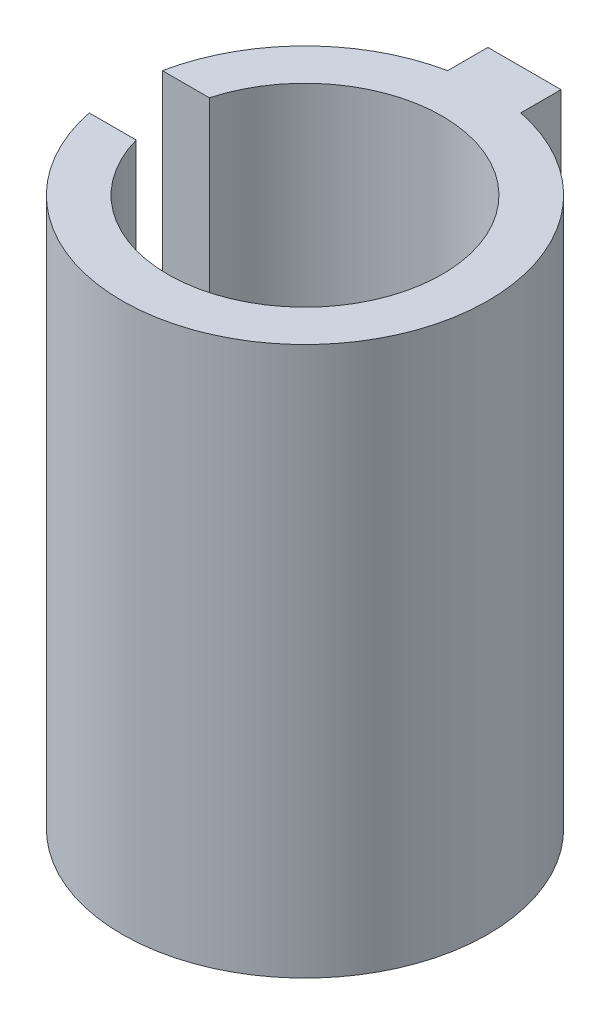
from build123d import *

# Parameters (mm, degrees)
EXTRUDE1_DEPTH = 30


with BuildPart() as part:
    # Sketch1 → Extrude1 (new body)
    with BuildSketch(Plane(origin=(0, 0, 0), x_dir=(1, 0, 0), z_dir=(0, 1, 0))):
        with BuildLine():
            Line((-7.228416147, 2), (-9.797958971, 2))
            ThreePointArc((-9.797958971, 2), (-7.071067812, 7.071067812), (-2, 9.797958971))
            Line((-2, 9.797958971), (-2, 12))
            Line((-2, 12), (2, 12))
            Line((2, 12), (2, 9.797958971))
            ThreePointArc((2, 9.797958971), (7.071067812, -7.071067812), (-9.797958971, -2))
            Line((-9.797958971, -2), (-7.228416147, -2))
            ThreePointArc((-7.228416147, -2), (7.5, 0), (-7.228416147, 2))
        make_face()
    extrude(amount=EXTRUDE1_DEPTH)


solid = part.part
